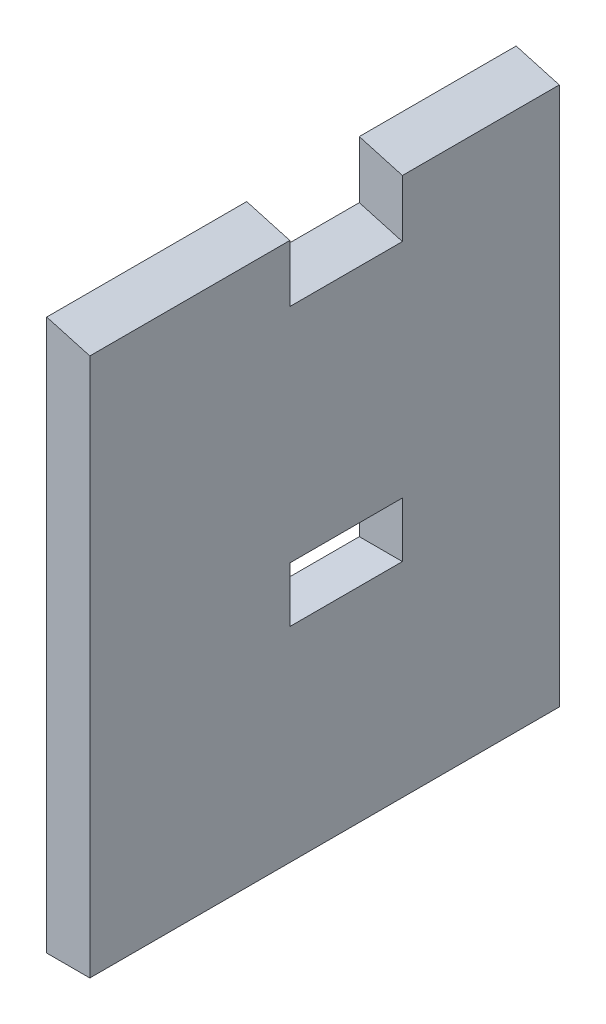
from build123d import *

# Parameters (mm, degrees)
BOSS_EXTRU_1_DEPTH      = 196
ESQUISSE2_W             = 47
ESQUISSE2_H             = 23
ENL_V_MAT_EXTRU_1_DEPTH = 228.958329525
ESQUISSE3_W             = 55.86091888
ESQUISSE3_H             = 47
ENL_V_MAT_EXTRU_2_DEPTH = 23


with BuildPart() as part:
    # Esquisse1 → Boss.-Extru.1 (new body)
    with BuildSketch(Plane.XY):
        Polygon((2.834611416, 111.667416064), (-9, 115), (-9, -115), (9, -115), (9, 109.931264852), align=None)
    extrude(amount=BOSS_EXTRU_1_DEPTH)

    # Esquisse2 → Enl_v. mat.-Extru.1 (cut, through all)
    with BuildSketch(Plane(origin=(9, 0, 0), x_dir=(0, 0, -1), z_dir=(1, 0, 0))):
        with Locations((-89, -18.168735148)):
            Rectangle(ESQUISSE2_W, ESQUISSE2_H)
    extrude(amount=-ENL_V_MAT_EXTRU_1_DEPTH, mode=Mode.SUBTRACT)

    # Esquisse3 → Enl_v. mat.-Extru.2 (cut)
    with BuildSketch(Plane(origin=(29.343110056, 104.202718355, 0), x_dir=(0.9625639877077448, -0.2710545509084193, 0), z_dir=(0.2710545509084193, 0.9625639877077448, 0))):
        with Locations((-26.221553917, -89)):
            Rectangle(ESQUISSE3_W, ESQUISSE3_H)
    extrude(amount=-ENL_V_MAT_EXTRU_2_DEPTH, mode=Mode.SUBTRACT)


solid = part.part
